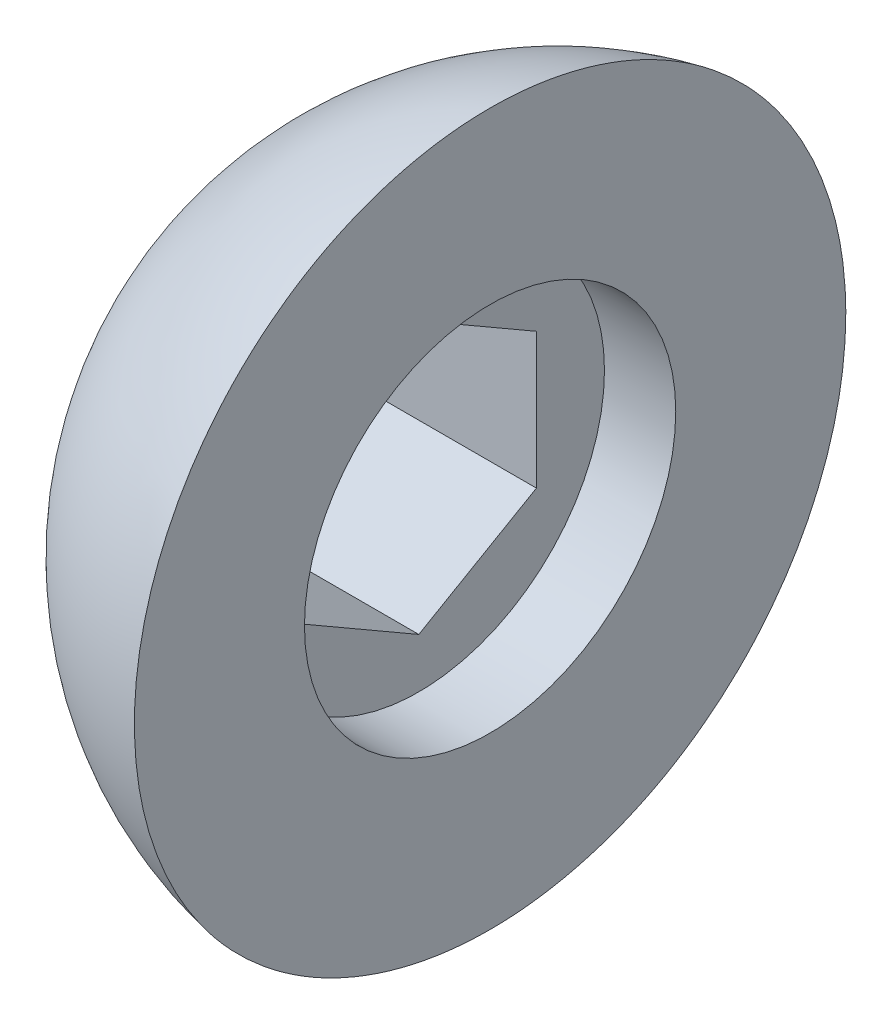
ISO-10303-21;
HEADER;
FILE_DESCRIPTION(('STEP AP214'),'2;1');
FILE_NAME('part.step','',(''),(''),'','','');
FILE_SCHEMA(('AUTOMOTIVE_DESIGN { 1 0 10303 214 1 1 1 1 }'));
ENDSEC;
DATA;
#1=APPLICATION_CONTEXT('core data for automotive mechanical design processes');
#2=APPLICATION_PROTOCOL_DEFINITION('international standard','automotive_design',2000,#1);
#3=PRODUCT_CONTEXT('',#1,'mechanical');
#4=PRODUCT('Part','Part','',(#3));
#5=PRODUCT_RELATED_PRODUCT_CATEGORY('part','',(#4));
#6=PRODUCT_DEFINITION_FORMATION('','',#4);
#7=PRODUCT_DEFINITION_CONTEXT('part definition',#1,'design');
#8=PRODUCT_DEFINITION('design','',#6,#7);
#9=PRODUCT_DEFINITION_SHAPE('','',#8);
#10=(LENGTH_UNIT() NAMED_UNIT(*) SI_UNIT(.MILLI.,.METRE.));
#11=(NAMED_UNIT(*) PLANE_ANGLE_UNIT() SI_UNIT($,.RADIAN.));
#12=(NAMED_UNIT(*) SI_UNIT($,.STERADIAN.) SOLID_ANGLE_UNIT());
#13=UNCERTAINTY_MEASURE_WITH_UNIT(LENGTH_MEASURE(1.E-05),#10,'distance_accuracy_value','');
#14=(GEOMETRIC_REPRESENTATION_CONTEXT(3) GLOBAL_UNCERTAINTY_ASSIGNED_CONTEXT((#13)) GLOBAL_UNIT_ASSIGNED_CONTEXT((#10,
#11,#12)) REPRESENTATION_CONTEXT('',''));
#15=CARTESIAN_POINT('',(0.,0.,0.));
#16=DIRECTION('',(0.,0.,1.));
#17=DIRECTION('',(1.,0.,0.));
#18=AXIS2_PLACEMENT_3D('',#15,#16,#17);
#19=CARTESIAN_POINT('',(1.92607341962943,0.952500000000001,1.64977839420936));
#20=DIRECTION('',(0.,0.,1.));
#21=DIRECTION('',(1.,0.,0.));
#22=AXIS2_PLACEMENT_3D('',#19,#20,#21);
#23=PLANE('',#22);
#24=DIRECTION('',(0.,1.,0.));
#25=VECTOR('',#24,1.);
#26=CARTESIAN_POINT('',(0.926073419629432,0.952500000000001,1.64977839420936));
#27=LINE('',#26,#25);
#28=CARTESIAN_POINT('',(0.926073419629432,-0.952500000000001,1.64977839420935));
#29=VERTEX_POINT('',#28);
#30=CARTESIAN_POINT('',(0.926073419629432,0.95249999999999,1.64977839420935));
#31=VERTEX_POINT('',#30);
#32=EDGE_CURVE('E89',#29,#31,#27,.T.);
#33=ORIENTED_EDGE('',*,*,#32,.F.);
#34=DIRECTION('',(1.,0.,0.));
#35=VECTOR('',#34,1.);
#36=CARTESIAN_POINT('',(1.92607341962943,-0.952500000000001,1.64977839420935));
#37=LINE('',#36,#35);
#38=CARTESIAN_POINT('',(-1.83071261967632,-0.9525,1.64977839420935));
#39=VERTEX_POINT('',#38);
#40=EDGE_CURVE('E38',#29,#39,#37,.F.);
#41=ORIENTED_EDGE('',*,*,#40,.T.);
#42=CARTESIAN_POINT('',(-1.83071261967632,0.952499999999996,1.64977839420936));
#43=CARTESIAN_POINT('',(-1.84350674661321,0.889247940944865,1.64977839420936));
#44=CARTESIAN_POINT('',(-1.85502505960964,0.825737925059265,1.64977839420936));
#45=CARTESIAN_POINT('',(-1.87542994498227,0.698708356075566,1.64977839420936));
#46=CARTESIAN_POINT('',(-1.88433269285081,0.635191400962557,1.64977839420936));
#47=CARTESIAN_POINT('',(-1.89955229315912,0.508153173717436,1.64977839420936));
#48=CARTESIAN_POINT('',(-1.90588117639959,0.444633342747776,1.64977839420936));
#49=CARTESIAN_POINT('',(-1.91598737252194,0.317593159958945,1.64977839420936));
#50=CARTESIAN_POINT('',(-1.91977268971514,0.254073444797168,1.64977839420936));
#51=CARTESIAN_POINT('',(-1.92481369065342,0.127035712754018,1.64977839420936));
#52=CARTESIAN_POINT('',(-1.92607341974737,0.063517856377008,1.64977839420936));
#53=CARTESIAN_POINT('',(-1.92607341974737,-0.0635178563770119,1.64977839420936));
#54=CARTESIAN_POINT('',(-1.92481369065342,-0.127035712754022,1.64977839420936));
#55=CARTESIAN_POINT('',(-1.91977268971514,-0.254073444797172,1.64977839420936));
#56=CARTESIAN_POINT('',(-1.91598737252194,-0.317593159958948,1.64977839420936));
#57=CARTESIAN_POINT('',(-1.90588117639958,-0.44463334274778,1.64977839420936));
#58=CARTESIAN_POINT('',(-1.89955229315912,-0.50815317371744,1.64977839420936));
#59=CARTESIAN_POINT('',(-1.88433269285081,-0.635191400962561,1.64977839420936));
#60=CARTESIAN_POINT('',(-1.87542994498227,-0.69870835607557,1.64977839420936));
#61=CARTESIAN_POINT('',(-1.85502505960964,-0.825737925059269,1.64977839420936));
#62=CARTESIAN_POINT('',(-1.84350674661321,-0.889247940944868,1.64977839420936));
#63=CARTESIAN_POINT('',(-1.83071261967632,-0.9525,1.64977839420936));
#64=B_SPLINE_CURVE_WITH_KNOTS('',3,(#42,#43,#44,#45,#46,#47,#48,#49,#50,#51,#52,#53,#54,#55,#56,
#57,#58,#59,#60,#61,#62,#63),.UNSPECIFIED.,.F.,.F.,(4,2,2,2,2,2,2,2,2,2,4),(0.,
0.193585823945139,0.38594795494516,0.577400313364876,0.768247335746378,0.958788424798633,
1.14932951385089,1.34017653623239,1.53162889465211,1.72399102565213,1.91757684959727),.UNSPECIFIED.);
#65=CARTESIAN_POINT('',(-1.83071261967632,0.952499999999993,1.64977839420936));
#66=VERTEX_POINT('',#65);
#67=EDGE_CURVE('E172',#66,#39,#64,.T.);
#68=ORIENTED_EDGE('',*,*,#67,.F.);
#69=DIRECTION('',(1.,0.,0.));
#70=VECTOR('',#69,1.);
#71=CARTESIAN_POINT('',(1.92607341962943,0.95249999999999,1.64977839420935));
#72=LINE('',#71,#70);
#73=EDGE_CURVE('E80',#66,#31,#72,.T.);
#74=ORIENTED_EDGE('',*,*,#73,.T.);
#75=EDGE_LOOP('',(#33,#41,#68,#74));
#76=FACE_BOUND('',#75,.T.);
#77=ADVANCED_FACE('F32',(#76),#23,.F.);
#78=CARTESIAN_POINT('',(1.92607341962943,-0.952500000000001,1.64977839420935));
#79=DIRECTION('',(0.,-0.866025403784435,0.500000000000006));
#80=DIRECTION('',(0.,-0.500000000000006,-0.866025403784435));
#81=AXIS2_PLACEMENT_3D('',#78,#79,#80);
#82=PLANE('',#81);
#83=DIRECTION('',(0.,0.500000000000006,0.866025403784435));
#84=VECTOR('',#83,1.);
#85=CARTESIAN_POINT('',(0.926073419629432,-0.952500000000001,1.64977839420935));
#86=LINE('',#85,#84);
#87=CARTESIAN_POINT('',(0.926073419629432,-1.90499999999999,0.));
#88=VERTEX_POINT('',#87);
#89=EDGE_CURVE('E86',#88,#29,#86,.T.);
#90=ORIENTED_EDGE('',*,*,#89,.F.);
#91=DIRECTION('',(1.,0.,0.));
#92=VECTOR('',#91,1.);
#93=CARTESIAN_POINT('',(1.92607341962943,-1.90499999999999,0.));
#94=LINE('',#93,#92);
#95=CARTESIAN_POINT('',(-1.83071261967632,-1.905,0.));
#96=VERTEX_POINT('',#95);
#97=EDGE_CURVE('E171',#88,#96,#94,.F.);
#98=ORIENTED_EDGE('',*,*,#97,.T.);
#99=CARTESIAN_POINT('',(-1.83071261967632,-0.9525,1.64977839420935));
#100=CARTESIAN_POINT('',(-1.84350674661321,-0.984126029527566,1.59500050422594));
#101=CARTESIAN_POINT('',(-1.85502505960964,-1.01588103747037,1.53999921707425));
#102=CARTESIAN_POINT('',(-1.87542994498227,-1.07939582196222,1.42998838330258));
#103=CARTESIAN_POINT('',(-1.88433269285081,-1.11115429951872,1.37498108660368));
#104=CARTESIAN_POINT('',(-1.89955229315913,-1.17467341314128,1.26496275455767));
#105=CARTESIAN_POINT('',(-1.90588117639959,-1.20643332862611,1.20995296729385));
#106=CARTESIAN_POINT('',(-1.91598737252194,-1.26995342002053,1.0999329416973));
#107=CARTESIAN_POINT('',(-1.91977268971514,-1.30171327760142,1.04492325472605));
#108=CARTESIAN_POINT('',(-1.92481369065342,-1.36523214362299,0.934905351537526));
#109=CARTESIAN_POINT('',(-1.92607341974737,-1.3969910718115,0.879897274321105));
#110=CARTESIAN_POINT('',(-1.92607341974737,-1.46050892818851,0.769881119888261));
#111=CARTESIAN_POINT('',(-1.92481369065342,-1.49226785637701,0.71487304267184));
#112=CARTESIAN_POINT('',(-1.91977268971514,-1.55578672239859,0.604855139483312));
#113=CARTESIAN_POINT('',(-1.91598737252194,-1.58754657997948,0.549845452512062));
#114=CARTESIAN_POINT('',(-1.90588117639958,-1.6510666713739,0.439825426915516));
#115=CARTESIAN_POINT('',(-1.89955229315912,-1.68282658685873,0.384815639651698));
#116=CARTESIAN_POINT('',(-1.88433269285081,-1.74634570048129,0.274797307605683));
#117=CARTESIAN_POINT('',(-1.87542994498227,-1.77810417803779,0.219790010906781));
#118=CARTESIAN_POINT('',(-1.85502505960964,-1.84161896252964,0.109779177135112));
#119=CARTESIAN_POINT('',(-1.84350674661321,-1.87337397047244,0.0547778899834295));
#120=CARTESIAN_POINT('',(-1.83071261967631,-1.90500000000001,0.));
#121=B_SPLINE_CURVE_WITH_KNOTS('',3,(#99,#100,#101,#102,#103,#104,#105,#106,#107,#108,#109,#110,
#111,#112,#113,#114,#115,#116,#117,#118,#119,#120),.UNSPECIFIED.,.F.,.F.,(4,2,2,2,2,2,2,2,2,2,
4),(0.,0.193585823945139,0.385947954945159,0.577400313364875,0.768247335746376,
0.958788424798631,1.14932951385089,1.34017653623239,1.5316288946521,1.72399102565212,
1.91757684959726),.UNSPECIFIED.);
#122=EDGE_CURVE('E165',#39,#96,#121,.T.);
#123=ORIENTED_EDGE('',*,*,#122,.F.);
#124=ORIENTED_EDGE('',*,*,#40,.F.);
#125=EDGE_LOOP('',(#90,#98,#123,#124));
#126=FACE_BOUND('',#125,.T.);
#127=ADVANCED_FACE('F177',(#126),#82,.F.);
#128=CARTESIAN_POINT('',(1.92607341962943,1.905,0.));
#129=DIRECTION('',(0.,0.866025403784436,0.500000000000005));
#130=DIRECTION('',(0.,-0.500000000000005,0.866025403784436));
#131=AXIS2_PLACEMENT_3D('',#128,#129,#130);
#132=PLANE('',#131);
#133=DIRECTION('',(0.,0.500000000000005,-0.866025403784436));
#134=VECTOR('',#133,1.);
#135=CARTESIAN_POINT('',(0.926073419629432,1.905,0.));
#136=LINE('',#135,#134);
#137=CARTESIAN_POINT('',(0.926073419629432,1.90500000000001,0.));
#138=VERTEX_POINT('',#137);
#139=EDGE_CURVE('E51',#31,#138,#136,.T.);
#140=ORIENTED_EDGE('',*,*,#139,.F.);
#141=ORIENTED_EDGE('',*,*,#73,.F.);
#142=CARTESIAN_POINT('',(-1.83071261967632,1.905,0.));
#143=CARTESIAN_POINT('',(-1.84350674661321,1.87337397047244,0.0547778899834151));
#144=CARTESIAN_POINT('',(-1.85502505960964,1.84161896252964,0.109779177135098));
#145=CARTESIAN_POINT('',(-1.87542994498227,1.77810417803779,0.219790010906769));
#146=CARTESIAN_POINT('',(-1.88433269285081,1.74634570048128,0.274797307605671));
#147=CARTESIAN_POINT('',(-1.89955229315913,1.68282658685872,0.384815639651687));
#148=CARTESIAN_POINT('',(-1.90588117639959,1.65106667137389,0.439825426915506));
#149=CARTESIAN_POINT('',(-1.91598737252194,1.58754657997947,0.549845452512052));
#150=CARTESIAN_POINT('',(-1.91977268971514,1.55578672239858,0.604855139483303));
#151=CARTESIAN_POINT('',(-1.92481369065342,1.49226785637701,0.714873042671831));
#152=CARTESIAN_POINT('',(-1.92607341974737,1.4605089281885,0.769881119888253));
#153=CARTESIAN_POINT('',(-1.92607341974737,1.39699107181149,0.879897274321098));
#154=CARTESIAN_POINT('',(-1.92481369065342,1.36523214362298,0.93490535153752));
#155=CARTESIAN_POINT('',(-1.91977268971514,1.30171327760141,1.04492325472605));
#156=CARTESIAN_POINT('',(-1.91598737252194,1.26995342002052,1.0999329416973));
#157=CARTESIAN_POINT('',(-1.90588117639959,1.2064333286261,1.20995296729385));
#158=CARTESIAN_POINT('',(-1.89955229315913,1.17467341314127,1.26496275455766));
#159=CARTESIAN_POINT('',(-1.88433269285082,1.11115429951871,1.37498108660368));
#160=CARTESIAN_POINT('',(-1.87542994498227,1.07939582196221,1.42998838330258));
#161=CARTESIAN_POINT('',(-1.85502505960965,1.01588103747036,1.53999921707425));
#162=CARTESIAN_POINT('',(-1.84350674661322,0.984126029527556,1.59500050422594));
#163=CARTESIAN_POINT('',(-1.83071261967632,0.952499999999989,1.64977839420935));
#164=B_SPLINE_CURVE_WITH_KNOTS('',3,(#142,#143,#144,#145,#146,#147,#148,#149,#150,#151,#152,
#153,#154,#155,#156,#157,#158,#159,#160,#161,#162,#163),.UNSPECIFIED.,.F.,.F.,(4,2,2,2,2,2,2,2,
2,2,4),(0.,0.19358582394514,0.385947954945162,0.577400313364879,0.768247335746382,
0.958788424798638,1.14932951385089,1.3401765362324,1.53162889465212,1.72399102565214,
1.91757684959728),.UNSPECIFIED.);
#165=CARTESIAN_POINT('',(-1.83071261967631,1.90500000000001,0.));
#166=VERTEX_POINT('',#165);
#167=EDGE_CURVE('E120',#166,#66,#164,.T.);
#168=ORIENTED_EDGE('',*,*,#167,.F.);
#169=DIRECTION('',(1.,0.,0.));
#170=VECTOR('',#169,1.);
#171=CARTESIAN_POINT('',(1.92607341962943,1.90500000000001,0.));
#172=LINE('',#171,#170);
#173=EDGE_CURVE('E112',#166,#138,#172,.T.);
#174=ORIENTED_EDGE('',*,*,#173,.T.);
#175=EDGE_LOOP('',(#140,#141,#168,#174));
#176=FACE_BOUND('',#175,.T.);
#177=ADVANCED_FACE('F155',(#176),#132,.F.);
#178=CARTESIAN_POINT('',(1.92607341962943,-1.90499999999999,0.));
#179=DIRECTION('',(0.,-0.866025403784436,-0.500000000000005));
#180=DIRECTION('',(0.,0.500000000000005,-0.866025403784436));
#181=AXIS2_PLACEMENT_3D('',#178,#179,#180);
#182=PLANE('',#181);
#183=DIRECTION('',(0.,-0.500000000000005,0.866025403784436));
#184=VECTOR('',#183,1.);
#185=CARTESIAN_POINT('',(0.926073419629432,-1.90499999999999,0.));
#186=LINE('',#185,#184);
#187=CARTESIAN_POINT('',(0.926073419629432,-0.952500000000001,-1.64977839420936));
#188=VERTEX_POINT('',#187);
#189=EDGE_CURVE('E105',#188,#88,#186,.T.);
#190=ORIENTED_EDGE('',*,*,#189,.F.);
#191=DIRECTION('',(-1.,0.,0.));
#192=VECTOR('',#191,1.);
#193=CARTESIAN_POINT('',(1.92607341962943,-0.952500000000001,-1.64977839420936));
#194=LINE('',#193,#192);
#195=CARTESIAN_POINT('',(-1.83071261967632,-0.952499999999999,-1.64977839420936));
#196=VERTEX_POINT('',#195);
#197=EDGE_CURVE('E104',#188,#196,#194,.T.);
#198=ORIENTED_EDGE('',*,*,#197,.T.);
#199=CARTESIAN_POINT('',(-1.83071261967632,-1.90499999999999,0.));
#200=CARTESIAN_POINT('',(-1.84350674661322,-1.87337397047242,-0.0547778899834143));
#201=CARTESIAN_POINT('',(-1.85502505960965,-1.84161896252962,-0.109779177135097));
#202=CARTESIAN_POINT('',(-1.87542994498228,-1.77810417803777,-0.219790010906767));
#203=CARTESIAN_POINT('',(-1.88433269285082,-1.74634570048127,-0.274797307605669));
#204=CARTESIAN_POINT('',(-1.89955229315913,-1.68282658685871,-0.384815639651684));
#205=CARTESIAN_POINT('',(-1.90588117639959,-1.65106667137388,-0.439825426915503));
#206=CARTESIAN_POINT('',(-1.91598737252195,-1.58754657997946,-0.549845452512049));
#207=CARTESIAN_POINT('',(-1.91977268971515,-1.55578672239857,-0.604855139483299));
#208=CARTESIAN_POINT('',(-1.92481369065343,-1.492267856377,-0.714873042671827));
#209=CARTESIAN_POINT('',(-1.92607341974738,-1.46050892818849,-0.769881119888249));
#210=CARTESIAN_POINT('',(-1.92607341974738,-1.39699107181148,-0.879897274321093));
#211=CARTESIAN_POINT('',(-1.92481369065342,-1.36523214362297,-0.934905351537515));
#212=CARTESIAN_POINT('',(-1.91977268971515,-1.3017132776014,-1.04492325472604));
#213=CARTESIAN_POINT('',(-1.91598737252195,-1.26995342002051,-1.09993294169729));
#214=CARTESIAN_POINT('',(-1.90588117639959,-1.20643332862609,-1.20995296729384));
#215=CARTESIAN_POINT('',(-1.89955229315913,-1.17467341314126,-1.26496275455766));
#216=CARTESIAN_POINT('',(-1.88433269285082,-1.1111542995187,-1.37498108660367));
#217=CARTESIAN_POINT('',(-1.87542994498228,-1.0793958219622,-1.42998838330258));
#218=CARTESIAN_POINT('',(-1.85502505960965,-1.01588103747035,-1.53999921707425));
#219=CARTESIAN_POINT('',(-1.84350674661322,-0.984126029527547,-1.59500050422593));
#220=CARTESIAN_POINT('',(-1.83071261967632,-0.952499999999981,-1.64977839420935));
#221=B_SPLINE_CURVE_WITH_KNOTS('',3,(#199,#200,#201,#202,#203,#204,#205,#206,#207,#208,#209,
#210,#211,#212,#213,#214,#215,#216,#217,#218,#219,#220),.UNSPECIFIED.,.F.,.F.,(4,2,2,2,2,2,2,2,
2,2,4),(0.,0.193585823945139,0.38594795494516,0.577400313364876,0.768247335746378,
0.958788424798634,1.14932951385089,1.34017653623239,1.53162889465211,1.72399102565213,
1.91757684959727),.UNSPECIFIED.);
#222=EDGE_CURVE('E115',#96,#196,#221,.T.);
#223=ORIENTED_EDGE('',*,*,#222,.F.);
#224=ORIENTED_EDGE('',*,*,#97,.F.);
#225=EDGE_LOOP('',(#190,#198,#223,#224));
#226=FACE_BOUND('',#225,.T.);
#227=ADVANCED_FACE('F151',(#226),#182,.F.);
#228=CARTESIAN_POINT('',(1.92607341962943,-0.952500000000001,-1.64977839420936));
#229=DIRECTION('',(0.,0.,-1.));
#230=DIRECTION('',(-1.,0.,0.));
#231=AXIS2_PLACEMENT_3D('',#228,#229,#230);
#232=PLANE('',#231);
#233=DIRECTION('',(0.,-1.,0.));
#234=VECTOR('',#233,1.);
#235=CARTESIAN_POINT('',(0.926073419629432,-0.952500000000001,-1.64977839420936));
#236=LINE('',#235,#234);
#237=CARTESIAN_POINT('',(0.926073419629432,0.952500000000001,-1.64977839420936));
#238=VERTEX_POINT('',#237);
#239=EDGE_CURVE('E97',#238,#188,#236,.T.);
#240=ORIENTED_EDGE('',*,*,#239,.F.);
#241=DIRECTION('',(1.,0.,0.));
#242=VECTOR('',#241,1.);
#243=CARTESIAN_POINT('',(1.92607341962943,0.952500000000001,-1.64977839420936));
#244=LINE('',#243,#242);
#245=CARTESIAN_POINT('',(-1.83071261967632,0.952500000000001,-1.64977839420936));
#246=VERTEX_POINT('',#245);
#247=EDGE_CURVE('E60',#238,#246,#244,.F.);
#248=ORIENTED_EDGE('',*,*,#247,.T.);
#249=CARTESIAN_POINT('',(-1.83071261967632,-0.952499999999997,-1.64977839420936));
#250=CARTESIAN_POINT('',(-1.84350674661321,-0.889247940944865,-1.64977839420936));
#251=CARTESIAN_POINT('',(-1.85502505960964,-0.825737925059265,-1.64977839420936));
#252=CARTESIAN_POINT('',(-1.87542994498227,-0.698708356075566,-1.64977839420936));
#253=CARTESIAN_POINT('',(-1.88433269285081,-0.635191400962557,-1.64977839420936));
#254=CARTESIAN_POINT('',(-1.89955229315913,-0.508153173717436,-1.64977839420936));
#255=CARTESIAN_POINT('',(-1.90588117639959,-0.444633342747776,-1.64977839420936));
#256=CARTESIAN_POINT('',(-1.91598737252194,-0.317593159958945,-1.64977839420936));
#257=CARTESIAN_POINT('',(-1.91977268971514,-0.254073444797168,-1.64977839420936));
#258=CARTESIAN_POINT('',(-1.92481369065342,-0.127035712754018,-1.64977839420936));
#259=CARTESIAN_POINT('',(-1.92607341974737,-0.0635178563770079,-1.64977839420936));
#260=CARTESIAN_POINT('',(-1.92607341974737,0.0635178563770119,-1.64977839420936));
#261=CARTESIAN_POINT('',(-1.92481369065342,0.127035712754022,-1.64977839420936));
#262=CARTESIAN_POINT('',(-1.91977268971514,0.254073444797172,-1.64977839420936));
#263=CARTESIAN_POINT('',(-1.91598737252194,0.317593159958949,-1.64977839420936));
#264=CARTESIAN_POINT('',(-1.90588117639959,0.44463334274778,-1.64977839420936));
#265=CARTESIAN_POINT('',(-1.89955229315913,0.50815317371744,-1.64977839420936));
#266=CARTESIAN_POINT('',(-1.88433269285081,0.635191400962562,-1.64977839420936));
#267=CARTESIAN_POINT('',(-1.87542994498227,0.698708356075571,-1.64977839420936));
#268=CARTESIAN_POINT('',(-1.85502505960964,0.825737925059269,-1.64977839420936));
#269=CARTESIAN_POINT('',(-1.84350674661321,0.889247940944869,-1.64977839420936));
#270=CARTESIAN_POINT('',(-1.83071261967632,0.952500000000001,-1.64977839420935));
#271=B_SPLINE_CURVE_WITH_KNOTS('',3,(#249,#250,#251,#252,#253,#254,#255,#256,#257,#258,#259,
#260,#261,#262,#263,#264,#265,#266,#267,#268,#269,#270),.UNSPECIFIED.,.F.,.F.,(4,2,2,2,2,2,2,2,
2,2,4),(0.,0.193585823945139,0.38594795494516,0.577400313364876,0.768247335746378,
0.958788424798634,1.14932951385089,1.34017653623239,1.53162889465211,1.72399102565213,
1.91757684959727),.UNSPECIFIED.);
#272=EDGE_CURVE('E139',#196,#246,#271,.T.);
#273=ORIENTED_EDGE('',*,*,#272,.F.);
#274=ORIENTED_EDGE('',*,*,#197,.F.);
#275=EDGE_LOOP('',(#240,#248,#273,#274));
#276=FACE_BOUND('',#275,.T.);
#277=ADVANCED_FACE('F103',(#276),#232,.F.);
#278=CARTESIAN_POINT('',(1.92607341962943,0.952500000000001,-1.64977839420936));
#279=DIRECTION('',(0.,0.866025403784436,-0.500000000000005));
#280=DIRECTION('',(0.,0.500000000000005,0.866025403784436));
#281=AXIS2_PLACEMENT_3D('',#278,#279,#280);
#282=PLANE('',#281);
#283=DIRECTION('',(0.,-0.500000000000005,-0.866025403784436));
#284=VECTOR('',#283,1.);
#285=CARTESIAN_POINT('',(0.926073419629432,0.952500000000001,-1.64977839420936));
#286=LINE('',#285,#284);
#287=EDGE_CURVE('E11',#138,#238,#286,.T.);
#288=ORIENTED_EDGE('',*,*,#287,.F.);
#289=ORIENTED_EDGE('',*,*,#173,.F.);
#290=CARTESIAN_POINT('',(-1.83071261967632,0.952500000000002,-1.64977839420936));
#291=CARTESIAN_POINT('',(-1.84350674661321,0.984126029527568,-1.59500050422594));
#292=CARTESIAN_POINT('',(-1.85502505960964,1.01588103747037,-1.53999921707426));
#293=CARTESIAN_POINT('',(-1.87542994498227,1.07939582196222,-1.42998838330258));
#294=CARTESIAN_POINT('',(-1.88433269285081,1.11115429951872,-1.37498108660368));
#295=CARTESIAN_POINT('',(-1.89955229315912,1.17467341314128,-1.26496275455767));
#296=CARTESIAN_POINT('',(-1.90588117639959,1.20643332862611,-1.20995296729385));
#297=CARTESIAN_POINT('',(-1.91598737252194,1.26995342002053,-1.0999329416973));
#298=CARTESIAN_POINT('',(-1.91977268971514,1.30171327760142,-1.04492325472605));
#299=CARTESIAN_POINT('',(-1.92481369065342,1.365232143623,-0.934905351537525));
#300=CARTESIAN_POINT('',(-1.92607341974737,1.3969910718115,-0.879897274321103));
#301=CARTESIAN_POINT('',(-1.92607341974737,1.46050892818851,-0.769881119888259));
#302=CARTESIAN_POINT('',(-1.92481369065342,1.49226785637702,-0.714873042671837));
#303=CARTESIAN_POINT('',(-1.91977268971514,1.55578672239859,-0.604855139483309));
#304=CARTESIAN_POINT('',(-1.91598737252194,1.58754657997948,-0.549845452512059));
#305=CARTESIAN_POINT('',(-1.90588117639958,1.6510666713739,-0.439825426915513));
#306=CARTESIAN_POINT('',(-1.89955229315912,1.68282658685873,-0.384815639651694));
#307=CARTESIAN_POINT('',(-1.88433269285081,1.74634570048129,-0.274797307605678));
#308=CARTESIAN_POINT('',(-1.87542994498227,1.77810417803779,-0.219790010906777));
#309=CARTESIAN_POINT('',(-1.85502505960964,1.84161896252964,-0.109779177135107));
#310=CARTESIAN_POINT('',(-1.84350674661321,1.87337397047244,-0.054777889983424));
#311=CARTESIAN_POINT('',(-1.83071261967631,1.90500000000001,0.));
#312=B_SPLINE_CURVE_WITH_KNOTS('',3,(#290,#291,#292,#293,#294,#295,#296,#297,#298,#299,#300,
#301,#302,#303,#304,#305,#306,#307,#308,#309,#310,#311),.UNSPECIFIED.,.F.,.F.,(4,2,2,2,2,2,2,2,
2,2,4),(0.,0.193585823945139,0.38594795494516,0.577400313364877,0.768247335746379,
0.958788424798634,1.14932951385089,1.34017653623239,1.53162889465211,1.72399102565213,
1.91757684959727),.UNSPECIFIED.);
#313=EDGE_CURVE('E44',#246,#166,#312,.T.);
#314=ORIENTED_EDGE('',*,*,#313,.F.);
#315=ORIENTED_EDGE('',*,*,#247,.F.);
#316=EDGE_LOOP('',(#288,#289,#314,#315));
#317=FACE_BOUND('',#316,.T.);
#318=ADVANCED_FACE('F108',(#317),#282,.F.);
#319=CARTESIAN_POINT('',(1.92607341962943,-0.461818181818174,0.));
#320=DIRECTION('',(1.,0.,0.));
#321=DIRECTION('',(0.,0.,-1.));
#322=AXIS2_PLACEMENT_3D('',#319,#320,#321);
#323=PLANE('',#322);
#324=CARTESIAN_POINT('',(1.92607341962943,-2.34290017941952E-10,0.));
#325=DIRECTION('',(1.,0.,0.));
#326=DIRECTION('',(0.,0.,-1.));
#327=AXIS2_PLACEMENT_3D('',#324,#325,#326);
#328=CIRCLE('',#327,2.6042567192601);
#329=CARTESIAN_POINT('',(1.92607341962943,-2.34290017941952E-10,-2.6042567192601));
#330=VERTEX_POINT('',#329);
#331=EDGE_CURVE('E208',#330,#330,#328,.T.);
#332=ORIENTED_EDGE('',*,*,#331,.F.);
#333=EDGE_LOOP('',(#332));
#334=FACE_BOUND('',#333,.T.);
#335=CARTESIAN_POINT('',(1.92607341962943,4.9899041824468,0.));
#336=CARTESIAN_POINT('',(1.92607341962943,4.98990478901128,-0.170465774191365));
#337=CARTESIAN_POINT('',(1.92607341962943,4.98116284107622,-0.34092210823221));
#338=CARTESIAN_POINT('',(1.92607341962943,4.94626927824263,-0.680188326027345));
#339=CARTESIAN_POINT('',(1.92607341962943,4.9201047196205,-0.848996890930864));
#340=CARTESIAN_POINT('',(1.92607341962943,4.8568296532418,-1.15326359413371));
#341=CARTESIAN_POINT('',(1.92607341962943,4.82249809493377,-1.28930750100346));
#342=CARTESIAN_POINT('',(1.92607341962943,4.74249125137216,-1.55806915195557));
#343=CARTESIAN_POINT('',(1.92607341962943,4.69681272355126,-1.69078593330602));
#344=CARTESIAN_POINT('',(1.92607341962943,4.5944039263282,-1.95199709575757));
#345=CARTESIAN_POINT('',(1.92607341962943,4.53766540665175,-2.08048824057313));
#346=CARTESIAN_POINT('',(1.92607341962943,4.41353914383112,-2.33227870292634));
#347=CARTESIAN_POINT('',(1.92607341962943,4.34614751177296,-2.45557610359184));
#348=CARTESIAN_POINT('',(1.92607341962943,4.20126701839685,-2.6959556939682));
#349=CARTESIAN_POINT('',(1.92607341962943,4.12378615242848,-2.81304270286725));
#350=CARTESIAN_POINT('',(1.92607341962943,3.95920639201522,-3.04031586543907));
#351=CARTESIAN_POINT('',(1.92607341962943,3.87210396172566,-3.15049945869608));
#352=CARTESIAN_POINT('',(1.92607341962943,3.68897912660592,-3.36307080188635));
#353=CARTESIAN_POINT('',(1.92607341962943,3.59296211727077,-3.46546319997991));
#354=CARTESIAN_POINT('',(1.92607341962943,3.39260916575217,-3.66183424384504));
#355=CARTESIAN_POINT('',(1.92607341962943,3.28827016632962,-3.75580977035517));
#356=CARTESIAN_POINT('',(1.92607341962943,3.07207474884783,-3.9346120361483));
#357=CARTESIAN_POINT('',(1.92607341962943,2.96022038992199,-4.01944126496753));
#358=CARTESIAN_POINT('',(1.92607341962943,2.7297242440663,-4.17940652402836));
#359=CARTESIAN_POINT('',(1.92607341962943,2.61107996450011,-4.25453896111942));
#360=CARTESIAN_POINT('',(1.92607341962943,2.36791389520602,-4.39451851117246));
#361=CARTESIAN_POINT('',(1.92607341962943,2.24339406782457,-4.45936902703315));
#362=CARTESIAN_POINT('',(1.92607341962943,1.98932220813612,-4.578367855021));
#363=CARTESIAN_POINT('',(1.92607341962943,1.85976830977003,-4.6325121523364));
#364=CARTESIAN_POINT('',(1.92607341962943,1.46504568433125,-4.77820896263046));
#365=CARTESIAN_POINT('',(1.92607341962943,1.19354633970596,-4.8531802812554));
#366=CARTESIAN_POINT('',(1.92607341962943,0.641808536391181,-4.9564092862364));
#367=CARTESIAN_POINT('',(1.92607341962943,0.361570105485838,-4.98466712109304));
#368=CARTESIAN_POINT('',(1.92607341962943,-0.0591235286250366,-4.99153389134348));
#369=CARTESIAN_POINT('',(1.92607341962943,-0.199486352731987,-4.9878912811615));
#370=CARTESIAN_POINT('',(1.92607341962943,-0.479388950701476,-4.96880010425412));
#371=CARTESIAN_POINT('',(1.92607341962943,-0.618929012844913,-4.95335595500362));
#372=CARTESIAN_POINT('',(1.92607341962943,-0.896254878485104,-4.91076046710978));
#373=CARTESIAN_POINT('',(1.92607341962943,-1.03404000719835,-4.88360475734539));
#374=CARTESIAN_POINT('',(1.92607341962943,-1.30678430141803,-4.81779290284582));
#375=CARTESIAN_POINT('',(1.92607341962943,-1.44174449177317,-4.77914100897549));
#376=CARTESIAN_POINT('',(1.92607341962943,-1.70798002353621,-4.6905902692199));
#377=CARTESIAN_POINT('',(1.92607341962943,-1.83925393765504,-4.64068713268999));
#378=CARTESIAN_POINT('',(1.92607341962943,-2.09708266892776,-4.53001780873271));
#379=CARTESIAN_POINT('',(1.92607341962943,-2.22363920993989,-4.46925563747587));
#380=CARTESIAN_POINT('',(1.92607341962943,-2.47122708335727,-4.33726498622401));
#381=CARTESIAN_POINT('',(1.92607341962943,-2.59225651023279,-4.26603293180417));
#382=CARTESIAN_POINT('',(1.92607341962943,-2.82783967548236,-4.11365276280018));
#383=CARTESIAN_POINT('',(1.92607341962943,-2.94239578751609,-4.03250831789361));
#384=CARTESIAN_POINT('',(1.92607341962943,-3.1643002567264,-3.860833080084));
#385=CARTESIAN_POINT('',(1.92607341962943,-3.27164641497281,-3.77029944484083));
#386=CARTESIAN_POINT('',(1.92607341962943,-3.47829131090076,-3.5805451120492));
#387=CARTESIAN_POINT('',(1.92607341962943,-3.57759300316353,-3.48132763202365));
#388=CARTESIAN_POINT('',(1.92607341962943,-3.7675375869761,-3.27482745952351));
#389=CARTESIAN_POINT('',(1.92607341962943,-3.8581758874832,-3.16754054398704));
#390=CARTESIAN_POINT('',(1.92607341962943,-4.03005791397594,-2.94575173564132));
#391=CARTESIAN_POINT('',(1.92607341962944,-4.11130508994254,-2.83125251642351));
#392=CARTESIAN_POINT('',(1.92607341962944,-4.26390639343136,-2.59575472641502));
#393=CARTESIAN_POINT('',(1.92607341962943,-4.33525527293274,-2.47475275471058));
#394=CARTESIAN_POINT('',(1.92607341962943,-4.46749354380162,-2.22718176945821));
#395=CARTESIAN_POINT('',(1.92607341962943,-4.52838416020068,-2.10061341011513));
#396=CARTESIAN_POINT('',(1.92607341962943,-4.63923324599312,-1.84290863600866));
#397=CARTESIAN_POINT('',(1.92607341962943,-4.6892015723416,-1.71177646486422));
#398=CARTESIAN_POINT('',(1.92607341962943,-4.77794018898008,-1.44572284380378));
#399=CARTESIAN_POINT('',(1.92607341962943,-4.81670516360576,-1.31079962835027));
#400=CARTESIAN_POINT('',(1.92607341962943,-4.89622730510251,-0.982404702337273));
#401=CARTESIAN_POINT('',(1.92607341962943,-4.93132742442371,-0.787534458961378));
#402=CARTESIAN_POINT('',(1.92607341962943,-4.97816045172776,-0.395100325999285));
#403=CARTESIAN_POINT('',(1.92607341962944,-4.98990268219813,-0.197537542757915));
#404=CARTESIAN_POINT('',(1.92607341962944,-4.98990547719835,0.170479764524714));
#405=CARTESIAN_POINT('',(1.92607341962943,-4.98116214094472,0.34094072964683));
#406=CARTESIAN_POINT('',(1.92607341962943,-4.94626646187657,0.680203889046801));
#407=CARTESIAN_POINT('',(1.92607341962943,-4.92010292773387,0.849004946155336));
#408=CARTESIAN_POINT('',(1.92607341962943,-4.85683010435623,1.15326188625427));
#409=CARTESIAN_POINT('',(1.92607341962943,-4.82249910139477,1.2893036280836));
#410=CARTESIAN_POINT('',(1.92607341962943,-4.74249373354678,1.55806130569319));
#411=CARTESIAN_POINT('',(1.92607341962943,-4.69681612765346,1.69077627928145));
#412=CARTESIAN_POINT('',(1.92607341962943,-4.59440798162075,1.95198772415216));
#413=CARTESIAN_POINT('',(1.92607341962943,-4.53766886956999,2.08048083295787));
#414=CARTESIAN_POINT('',(1.92607341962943,-4.4135411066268,2.33227510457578));
#415=CARTESIAN_POINT('',(1.92607341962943,-4.34614856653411,2.45557435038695));
#416=CARTESIAN_POINT('',(1.92607341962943,-4.20126580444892,2.69595771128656));
#417=CARTESIAN_POINT('',(1.92607341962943,-4.12378355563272,2.81304663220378));
#418=CARTESIAN_POINT('',(1.92607341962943,-3.95920073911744,3.04032332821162));
#419=CARTESIAN_POINT('',(1.92607341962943,-3.87209663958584,3.1505085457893));
#420=CARTESIAN_POINT('',(1.92607341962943,-3.68897133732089,3.36307925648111));
#421=CARTESIAN_POINT('',(1.92607341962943,-3.5929558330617,3.46546965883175));
#422=CARTESIAN_POINT('',(1.92607341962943,-3.39260584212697,3.6618372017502));
#423=CARTESIAN_POINT('',(1.92607341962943,-3.28826828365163,3.75581120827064));
#424=CARTESIAN_POINT('',(1.92607341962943,-3.07208290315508,3.93460541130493));
#425=CARTESIAN_POINT('',(1.92607341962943,-2.96023757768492,4.01942862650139));
#426=CARTESIAN_POINT('',(1.92607341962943,-2.72975890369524,4.17938318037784));
#427=CARTESIAN_POINT('',(1.92607341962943,-2.61112311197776,4.2545109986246));
#428=CARTESIAN_POINT('',(1.92607341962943,-2.36796643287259,4.39449138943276));
#429=CARTESIAN_POINT('',(1.92607341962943,-2.24344666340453,4.45934590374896));
#430=CARTESIAN_POINT('',(1.92607341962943,-1.98933683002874,4.57835949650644));
#431=CARTESIAN_POINT('',(1.92607341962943,-1.85974472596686,4.63251421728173));
#432=CARTESIAN_POINT('',(1.92607341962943,-1.59018160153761,4.73202676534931));
#433=CARTESIAN_POINT('',(1.92607341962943,-1.45001021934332,4.77684280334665));
#434=CARTESIAN_POINT('',(1.92607341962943,-1.16618659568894,4.8539458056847));
#435=CARTESIAN_POINT('',(1.92607341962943,-1.02253258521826,4.88622625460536));
#436=CARTESIAN_POINT('',(1.92607341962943,-0.732935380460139,4.9379738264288));
#437=CARTESIAN_POINT('',(1.92607341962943,-0.58699219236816,4.95744098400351));
#438=CARTESIAN_POINT('',(1.92607341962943,-0.294031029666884,4.98340269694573));
#439=CARTESIAN_POINT('',(1.92607341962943,-0.147013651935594,4.98990397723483));
#440=CARTESIAN_POINT('',(1.92607341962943,0.140327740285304,4.9899043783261));
#441=CARTESIAN_POINT('',(1.92607341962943,0.280652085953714,4.98398136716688));
#442=CARTESIAN_POINT('',(1.92607341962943,0.56024753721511,4.96033675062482));
#443=CARTESIAN_POINT('',(1.92607341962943,0.69951904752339,4.94261993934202));
#444=CARTESIAN_POINT('',(1.92607341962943,0.976106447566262,4.89551271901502));
#445=CARTESIAN_POINT('',(1.92607341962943,1.1134218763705,4.86611960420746));
#446=CARTESIAN_POINT('',(1.92607341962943,1.38503900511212,4.79588164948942));
#447=CARTESIAN_POINT('',(1.92607341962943,1.51934177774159,4.75504095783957));
#448=CARTESIAN_POINT('',(1.92607341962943,1.78408945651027,4.66217291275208));
#449=CARTESIAN_POINT('',(1.92607341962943,1.91453262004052,4.61014059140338));
#450=CARTESIAN_POINT('',(1.92607341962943,2.17052339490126,4.49529143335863));
#451=CARTESIAN_POINT('',(1.92607341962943,2.29607280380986,4.4324786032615));
#452=CARTESIAN_POINT('',(1.92607341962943,2.54147990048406,4.29647659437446));
#453=CARTESIAN_POINT('',(1.92607341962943,2.66133549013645,4.22328362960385));
#454=CARTESIAN_POINT('',(1.92607341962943,2.89441035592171,4.06708808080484));
#455=CARTESIAN_POINT('',(1.92607341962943,3.00763206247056,3.98408912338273));
#456=CARTESIAN_POINT('',(1.92607341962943,3.22671276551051,3.80882557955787));
#457=CARTESIAN_POINT('',(1.92607341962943,3.33256971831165,3.71655843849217));
#458=CARTESIAN_POINT('',(1.92607341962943,3.53609614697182,3.52346947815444));
#459=CARTESIAN_POINT('',(1.92607341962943,3.63376863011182,3.42265082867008));
#460=CARTESIAN_POINT('',(1.92607341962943,3.82032694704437,3.21308832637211));
#461=CARTESIAN_POINT('',(1.92607341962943,3.90920793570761,3.10434016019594));
#462=CARTESIAN_POINT('',(1.92607341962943,4.07746081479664,2.87978026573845));
#463=CARTESIAN_POINT('',(1.92607341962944,4.15683600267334,2.7639710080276));
#464=CARTESIAN_POINT('',(1.92607341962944,4.30559152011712,2.52600965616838));
#465=CARTESIAN_POINT('',(1.92607341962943,4.37496611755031,2.40385397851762));
#466=CARTESIAN_POINT('',(1.92607341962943,4.50316664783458,2.15414268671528));
#467=CARTESIAN_POINT('',(1.92607341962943,4.56199356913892,2.02658757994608));
#468=CARTESIAN_POINT('',(1.92607341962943,4.66864093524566,1.76708632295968));
#469=CARTESIAN_POINT('',(1.92607341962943,4.71647115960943,1.63514419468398));
#470=CARTESIAN_POINT('',(1.92607341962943,4.80085546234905,1.36769928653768));
#471=CARTESIAN_POINT('',(1.92607341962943,4.83740839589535,1.23219614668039));
#472=CARTESIAN_POINT('',(1.92607341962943,4.90859808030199,0.915789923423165));
#473=CARTESIAN_POINT('',(1.92607341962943,4.93906604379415,0.733932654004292));
#474=CARTESIAN_POINT('',(1.92607341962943,4.9797150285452,0.368046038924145));
#475=CARTESIAN_POINT('',(1.92607341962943,4.98990352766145,0.184017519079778));
#476=CARTESIAN_POINT('',(1.92607341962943,4.9899041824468,0.));
#477=B_SPLINE_CURVE_WITH_KNOTS('',3,(#335,#336,#337,#338,#339,#340,#341,#342,#343,#344,#345,
#346,#347,#348,#349,#350,#351,#352,#353,#354,#355,#356,#357,#358,#359,#360,#361,#362,#363,#364,
#365,#366,#367,#368,#369,#370,#371,#372,#373,#374,#375,#376,#377,#378,#379,#380,#381,#382,#383,
#384,#385,#386,#387,#388,#389,#390,#391,#392,#393,#394,#395,#396,#397,#398,#399,#400,#401,#402,
#403,#404,#405,#406,#407,#408,#409,#410,#411,#412,#413,#414,#415,#416,#417,#418,#419,#420,#421,
#422,#423,#424,#425,#426,#427,#428,#429,#430,#431,#432,#433,#434,#435,#436,#437,#438,#439,#440,
#441,#442,#443,#444,#445,#446,#447,#448,#449,#450,#451,#452,#453,#454,#455,#456,#457,#458,#459,
#460,#461,#462,#463,#464,#465,#466,#467,#468,#469,#470,#471,#472,#473,#474,#475,#476),
.UNSPECIFIED.,.T.,.F.,(4,2,2,2,2,2,2,2,2,2,2,2,2,2,2,2,2,2,2,2,2,2,2,2,2,2,2,2,2,2,2,2,2,2,2,2,
2,2,2,2,2,2,2,2,2,2,2,2,2,2,2,2,2,2,2,2,2,2,2,2,2,2,2,2,2,2,2,2,2,2,4),(0.,0.511163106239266,
1.02270639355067,1.4431552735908,1.86372444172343,2.28460854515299,2.70564664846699,
3.12635310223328,3.54721467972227,3.967823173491,4.38858690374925,4.8092358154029,
5.23004015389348,5.65070493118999,6.07152715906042,6.91225049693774,7.7529711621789,
8.17378458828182,8.59444057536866,9.0152537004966,9.43591141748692,9.85672982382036,
10.2773929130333,10.6981999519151,11.118851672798,11.5396311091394,11.9602552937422,
12.3811011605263,12.8017919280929,13.2227048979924,13.6435685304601,14.0640507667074,
14.4847321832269,15.077291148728,15.669613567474,16.1808024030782,16.6923199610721,
17.1127627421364,17.5333257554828,17.9542159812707,18.3752602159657,18.7959737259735,
19.2168421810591,19.637443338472,20.0582004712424,20.4788183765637,20.8995885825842,
21.320279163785,21.7411407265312,22.1820460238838,22.6231801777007,23.0643131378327,
23.5052172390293,23.9260698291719,24.3467514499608,24.7675306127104,25.1881574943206,
25.6089714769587,26.029629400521,26.4504411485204,26.8710977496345,27.2918706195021,
27.7124881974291,28.1333363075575,28.5540380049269,28.974979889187,29.3958823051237,
29.8164089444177,30.2369782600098,30.7889815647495,31.3407812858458),.UNSPECIFIED.);
#478=CARTESIAN_POINT('',(1.92607341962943,4.9899041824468,0.));
#479=VERTEX_POINT('',#478);
#480=EDGE_CURVE('E111',#479,#479,#477,.T.);
#481=ORIENTED_EDGE('',*,*,#480,.F.);
#482=EDGE_LOOP('',(#481));
#483=FACE_BOUND('',#482,.T.);
#484=ADVANCED_FACE('F147',(#334,#483),#323,.T.);
#485=CARTESIAN_POINT('',(2.87857341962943,0.,0.));
#486=DIRECTION('',(0.,1.,0.));
#487=DIRECTION('',(0.,0.,-1.));
#488=AXIS2_PLACEMENT_3D('',#485,#486,#487);
#489=SPHERICAL_SURFACE('',#488,5.08);
#490=ORIENTED_EDGE('',*,*,#480,.T.);
#491=EDGE_LOOP('',(#490));
#492=FACE_BOUND('',#491,.T.);
#493=ORIENTED_EDGE('',*,*,#272,.T.);
#494=ORIENTED_EDGE('',*,*,#313,.T.);
#495=ORIENTED_EDGE('',*,*,#167,.T.);
#496=ORIENTED_EDGE('',*,*,#67,.T.);
#497=ORIENTED_EDGE('',*,*,#122,.T.);
#498=ORIENTED_EDGE('',*,*,#222,.T.);
#499=EDGE_LOOP('',(#493,#494,#495,#496,#497,#498));
#500=FACE_BOUND('',#499,.T.);
#501=ADVANCED_FACE('F34',(#492,#500),#489,.T.);
#502=CARTESIAN_POINT('',(0.926073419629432,-2.34290017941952E-10,0.));
#503=DIRECTION('',(1.,0.,0.));
#504=DIRECTION('',(0.,0.,-1.));
#505=AXIS2_PLACEMENT_3D('',#502,#503,#504);
#506=PLANE('',#505);
#507=CARTESIAN_POINT('',(0.926073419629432,-2.34290017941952E-10,0.));
#508=DIRECTION('',(1.,0.,0.));
#509=DIRECTION('',(0.,0.,-1.));
#510=AXIS2_PLACEMENT_3D('',#507,#508,#509);
#511=CIRCLE('',#510,2.6042567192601);
#512=CARTESIAN_POINT('',(0.926073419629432,-2.34290017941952E-10,-2.6042567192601));
#513=VERTEX_POINT('',#512);
#514=EDGE_CURVE('E106',#513,#513,#511,.T.);
#515=ORIENTED_EDGE('',*,*,#514,.T.);
#516=EDGE_LOOP('',(#515));
#517=FACE_BOUND('',#516,.T.);
#518=ORIENTED_EDGE('',*,*,#32,.T.);
#519=ORIENTED_EDGE('',*,*,#139,.T.);
#520=ORIENTED_EDGE('',*,*,#287,.T.);
#521=ORIENTED_EDGE('',*,*,#239,.T.);
#522=ORIENTED_EDGE('',*,*,#189,.T.);
#523=ORIENTED_EDGE('',*,*,#89,.T.);
#524=EDGE_LOOP('',(#518,#519,#520,#521,#522,#523));
#525=FACE_BOUND('',#524,.T.);
#526=ADVANCED_FACE('F96',(#517,#525),#506,.T.);
#527=CARTESIAN_POINT('',(0.926073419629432,-2.34290017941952E-10,0.));
#528=DIRECTION('',(1.,0.,0.));
#529=DIRECTION('',(0.,0.,-1.));
#530=AXIS2_PLACEMENT_3D('',#527,#528,#529);
#531=CYLINDRICAL_SURFACE('',#530,2.6042567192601);
#532=ORIENTED_EDGE('',*,*,#514,.F.);
#533=EDGE_LOOP('',(#532));
#534=FACE_BOUND('',#533,.T.);
#535=ORIENTED_EDGE('',*,*,#331,.T.);
#536=EDGE_LOOP('',(#535));
#537=FACE_BOUND('',#536,.T.);
#538=ADVANCED_FACE('F215',(#534,#537),#531,.F.);
#539=CLOSED_SHELL('',(#77,#127,#177,#227,#277,#318,#484,#501,#526,#538));
#540=MANIFOLD_SOLID_BREP('B2',#539);
#541=ADVANCED_BREP_SHAPE_REPRESENTATION('',(#18,#540),#14);
#542=SHAPE_DEFINITION_REPRESENTATION(#9,#541);
ENDSEC;
END-ISO-10303-21;
